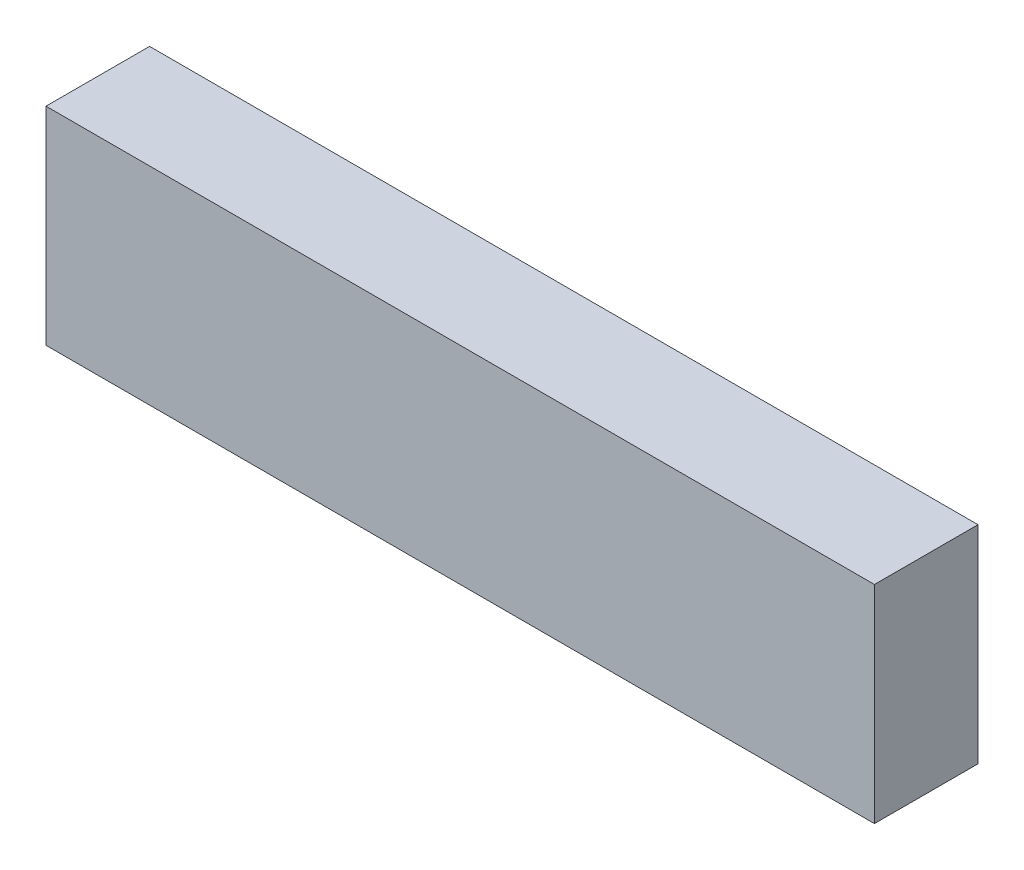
ISO-10303-21;
HEADER;
FILE_DESCRIPTION(('STEP AP214'),'2;1');
FILE_NAME('part.step','',(''),(''),'','','');
FILE_SCHEMA(('AUTOMOTIVE_DESIGN { 1 0 10303 214 1 1 1 1 }'));
ENDSEC;
DATA;
#1=APPLICATION_CONTEXT('core data for automotive mechanical design processes');
#2=APPLICATION_PROTOCOL_DEFINITION('international standard','automotive_design',2000,#1);
#3=PRODUCT_CONTEXT('',#1,'mechanical');
#4=PRODUCT('Part','Part','',(#3));
#5=PRODUCT_RELATED_PRODUCT_CATEGORY('part','',(#4));
#6=PRODUCT_DEFINITION_FORMATION('','',#4);
#7=PRODUCT_DEFINITION_CONTEXT('part definition',#1,'design');
#8=PRODUCT_DEFINITION('design','',#6,#7);
#9=PRODUCT_DEFINITION_SHAPE('','',#8);
#10=(LENGTH_UNIT() NAMED_UNIT(*) SI_UNIT(.MILLI.,.METRE.));
#11=(NAMED_UNIT(*) PLANE_ANGLE_UNIT() SI_UNIT($,.RADIAN.));
#12=(NAMED_UNIT(*) SI_UNIT($,.STERADIAN.) SOLID_ANGLE_UNIT());
#13=UNCERTAINTY_MEASURE_WITH_UNIT(LENGTH_MEASURE(1.E-05),#10,'distance_accuracy_value','');
#14=(GEOMETRIC_REPRESENTATION_CONTEXT(3) GLOBAL_UNCERTAINTY_ASSIGNED_CONTEXT((#13)) GLOBAL_UNIT_ASSIGNED_CONTEXT((#10,
#11,#12)) REPRESENTATION_CONTEXT('',''));
#15=CARTESIAN_POINT('',(0.,0.,0.));
#16=DIRECTION('',(0.,0.,1.));
#17=DIRECTION('',(1.,0.,0.));
#18=AXIS2_PLACEMENT_3D('',#15,#16,#17);
#19=CARTESIAN_POINT('',(40.,-10.,10.));
#20=DIRECTION('',(-1.,0.,0.));
#21=DIRECTION('',(0.,0.,1.));
#22=AXIS2_PLACEMENT_3D('',#19,#20,#21);
#23=PLANE('',#22);
#24=DIRECTION('',(0.,1.,0.));
#25=VECTOR('',#24,1.);
#26=CARTESIAN_POINT('',(40.,-10.,0.));
#27=LINE('',#26,#25);
#28=CARTESIAN_POINT('',(40.,-10.,0.));
#29=VERTEX_POINT('',#28);
#30=CARTESIAN_POINT('',(40.,10.,0.));
#31=VERTEX_POINT('',#30);
#32=EDGE_CURVE('E96',#29,#31,#27,.T.);
#33=ORIENTED_EDGE('',*,*,#32,.T.);
#34=DIRECTION('',(0.,0.,-1.));
#35=VECTOR('',#34,1.);
#36=CARTESIAN_POINT('',(40.,10.,10.));
#37=LINE('',#36,#35);
#38=CARTESIAN_POINT('',(40.,10.,10.));
#39=VERTEX_POINT('',#38);
#40=EDGE_CURVE('E11',#39,#31,#37,.T.);
#41=ORIENTED_EDGE('',*,*,#40,.F.);
#42=DIRECTION('',(0.,1.,0.));
#43=VECTOR('',#42,1.);
#44=CARTESIAN_POINT('',(40.,-10.,10.));
#45=LINE('',#44,#43);
#46=CARTESIAN_POINT('',(40.,-10.,10.));
#47=VERTEX_POINT('',#46);
#48=EDGE_CURVE('E84',#47,#39,#45,.T.);
#49=ORIENTED_EDGE('',*,*,#48,.F.);
#50=DIRECTION('',(0.,0.,-1.));
#51=VECTOR('',#50,1.);
#52=CARTESIAN_POINT('',(40.,-10.,10.));
#53=LINE('',#52,#51);
#54=EDGE_CURVE('E92',#47,#29,#53,.T.);
#55=ORIENTED_EDGE('',*,*,#54,.T.);
#56=EDGE_LOOP('',(#33,#41,#49,#55));
#57=FACE_BOUND('',#56,.T.);
#58=ADVANCED_FACE('F33',(#57),#23,.F.);
#59=CARTESIAN_POINT('',(-40.,10.,10.));
#60=DIRECTION('',(0.,-1.,0.));
#61=DIRECTION('',(0.,0.,-1.));
#62=AXIS2_PLACEMENT_3D('',#59,#60,#61);
#63=PLANE('',#62);
#64=DIRECTION('',(-1.,0.,0.));
#65=VECTOR('',#64,1.);
#66=CARTESIAN_POINT('',(-40.,10.,0.));
#67=LINE('',#66,#65);
#68=CARTESIAN_POINT('',(-40.,10.,0.));
#69=VERTEX_POINT('',#68);
#70=EDGE_CURVE('E88',#31,#69,#67,.T.);
#71=ORIENTED_EDGE('',*,*,#70,.T.);
#72=DIRECTION('',(0.,0.,-1.));
#73=VECTOR('',#72,1.);
#74=CARTESIAN_POINT('',(-40.,10.,10.));
#75=LINE('',#74,#73);
#76=CARTESIAN_POINT('',(-40.,10.,10.));
#77=VERTEX_POINT('',#76);
#78=EDGE_CURVE('E41',#77,#69,#75,.T.);
#79=ORIENTED_EDGE('',*,*,#78,.F.);
#80=DIRECTION('',(-1.,0.,0.));
#81=VECTOR('',#80,1.);
#82=CARTESIAN_POINT('',(-40.,10.,10.));
#83=LINE('',#82,#81);
#84=EDGE_CURVE('E79',#39,#77,#83,.T.);
#85=ORIENTED_EDGE('',*,*,#84,.F.);
#86=ORIENTED_EDGE('',*,*,#40,.T.);
#87=EDGE_LOOP('',(#71,#79,#85,#86));
#88=FACE_BOUND('',#87,.T.);
#89=ADVANCED_FACE('F87',(#88),#63,.F.);
#90=CARTESIAN_POINT('',(-40.,-10.,10.));
#91=DIRECTION('',(1.,0.,0.));
#92=DIRECTION('',(0.,0.,-1.));
#93=AXIS2_PLACEMENT_3D('',#90,#91,#92);
#94=PLANE('',#93);
#95=DIRECTION('',(0.,-1.,0.));
#96=VECTOR('',#95,1.);
#97=CARTESIAN_POINT('',(-40.,-10.,0.));
#98=LINE('',#97,#96);
#99=CARTESIAN_POINT('',(-40.,-10.,0.));
#100=VERTEX_POINT('',#99);
#101=EDGE_CURVE('E66',#69,#100,#98,.T.);
#102=ORIENTED_EDGE('',*,*,#101,.T.);
#103=DIRECTION('',(0.,0.,-1.));
#104=VECTOR('',#103,1.);
#105=CARTESIAN_POINT('',(-40.,-10.,10.));
#106=LINE('',#105,#104);
#107=CARTESIAN_POINT('',(-40.,-10.,10.));
#108=VERTEX_POINT('',#107);
#109=EDGE_CURVE('E89',#108,#100,#106,.T.);
#110=ORIENTED_EDGE('',*,*,#109,.F.);
#111=DIRECTION('',(0.,-1.,0.));
#112=VECTOR('',#111,1.);
#113=CARTESIAN_POINT('',(-40.,-10.,10.));
#114=LINE('',#113,#112);
#115=EDGE_CURVE('E82',#77,#108,#114,.T.);
#116=ORIENTED_EDGE('',*,*,#115,.F.);
#117=ORIENTED_EDGE('',*,*,#78,.T.);
#118=EDGE_LOOP('',(#102,#110,#116,#117));
#119=FACE_BOUND('',#118,.T.);
#120=ADVANCED_FACE('F90',(#119),#94,.F.);
#121=CARTESIAN_POINT('',(-40.,-10.,10.));
#122=DIRECTION('',(0.,1.,0.));
#123=DIRECTION('',(0.,0.,1.));
#124=AXIS2_PLACEMENT_3D('',#121,#122,#123);
#125=PLANE('',#124);
#126=DIRECTION('',(1.,0.,0.));
#127=VECTOR('',#126,1.);
#128=CARTESIAN_POINT('',(-40.,-10.,0.));
#129=LINE('',#128,#127);
#130=EDGE_CURVE('E72',#100,#29,#129,.T.);
#131=ORIENTED_EDGE('',*,*,#130,.T.);
#132=ORIENTED_EDGE('',*,*,#54,.F.);
#133=DIRECTION('',(1.,0.,0.));
#134=VECTOR('',#133,1.);
#135=CARTESIAN_POINT('',(-40.,-10.,10.));
#136=LINE('',#135,#134);
#137=EDGE_CURVE('E49',#108,#47,#136,.T.);
#138=ORIENTED_EDGE('',*,*,#137,.F.);
#139=ORIENTED_EDGE('',*,*,#109,.T.);
#140=EDGE_LOOP('',(#131,#132,#138,#139));
#141=FACE_BOUND('',#140,.T.);
#142=ADVANCED_FACE('F103',(#141),#125,.F.);
#143=CARTESIAN_POINT('',(0.,0.,10.));
#144=DIRECTION('',(0.,0.,-1.));
#145=DIRECTION('',(-1.,0.,0.));
#146=AXIS2_PLACEMENT_3D('',#143,#144,#145);
#147=PLANE('',#146);
#148=ORIENTED_EDGE('',*,*,#48,.T.);
#149=ORIENTED_EDGE('',*,*,#84,.T.);
#150=ORIENTED_EDGE('',*,*,#115,.T.);
#151=ORIENTED_EDGE('',*,*,#137,.T.);
#152=EDGE_LOOP('',(#148,#149,#150,#151));
#153=FACE_BOUND('',#152,.T.);
#154=ADVANCED_FACE('F80',(#153),#147,.F.);
#155=CARTESIAN_POINT('',(0.,0.,0.));
#156=DIRECTION('',(0.,0.,-1.));
#157=DIRECTION('',(-1.,0.,0.));
#158=AXIS2_PLACEMENT_3D('',#155,#156,#157);
#159=PLANE('',#158);
#160=ORIENTED_EDGE('',*,*,#32,.F.);
#161=ORIENTED_EDGE('',*,*,#130,.F.);
#162=ORIENTED_EDGE('',*,*,#101,.F.);
#163=ORIENTED_EDGE('',*,*,#70,.F.);
#164=EDGE_LOOP('',(#160,#161,#162,#163));
#165=FACE_BOUND('',#164,.T.);
#166=ADVANCED_FACE('F106',(#165),#159,.T.);
#167=CLOSED_SHELL('',(#58,#89,#120,#142,#154,#166));
#168=MANIFOLD_SOLID_BREP('B2',#167);
#169=ADVANCED_BREP_SHAPE_REPRESENTATION('',(#18,#168),#14);
#170=SHAPE_DEFINITION_REPRESENTATION(#9,#169);
ENDSEC;
END-ISO-10303-21;
